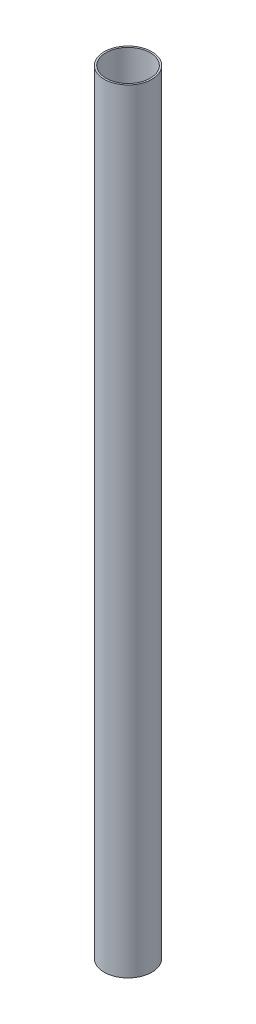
ISO-10303-21;
HEADER;
FILE_DESCRIPTION(('STEP AP214'),'2;1');
FILE_NAME('part.step','',(''),(''),'','','');
FILE_SCHEMA(('AUTOMOTIVE_DESIGN { 1 0 10303 214 1 1 1 1 }'));
ENDSEC;
DATA;
#1=APPLICATION_CONTEXT('core data for automotive mechanical design processes');
#2=APPLICATION_PROTOCOL_DEFINITION('international standard','automotive_design',2000,#1);
#3=PRODUCT_CONTEXT('',#1,'mechanical');
#4=PRODUCT('Part','Part','',(#3));
#5=PRODUCT_RELATED_PRODUCT_CATEGORY('part','',(#4));
#6=PRODUCT_DEFINITION_FORMATION('','',#4);
#7=PRODUCT_DEFINITION_CONTEXT('part definition',#1,'design');
#8=PRODUCT_DEFINITION('design','',#6,#7);
#9=PRODUCT_DEFINITION_SHAPE('','',#8);
#10=(LENGTH_UNIT() NAMED_UNIT(*) SI_UNIT(.MILLI.,.METRE.));
#11=(NAMED_UNIT(*) PLANE_ANGLE_UNIT() SI_UNIT($,.RADIAN.));
#12=(NAMED_UNIT(*) SI_UNIT($,.STERADIAN.) SOLID_ANGLE_UNIT());
#13=UNCERTAINTY_MEASURE_WITH_UNIT(LENGTH_MEASURE(1.E-05),#10,'distance_accuracy_value','');
#14=(GEOMETRIC_REPRESENTATION_CONTEXT(3) GLOBAL_UNCERTAINTY_ASSIGNED_CONTEXT((#13)) GLOBAL_UNIT_ASSIGNED_CONTEXT((#10,
#11,#12)) REPRESENTATION_CONTEXT('',''));
#15=CARTESIAN_POINT('',(0.,0.,0.));
#16=DIRECTION('',(0.,0.,1.));
#17=DIRECTION('',(1.,0.,0.));
#18=AXIS2_PLACEMENT_3D('',#15,#16,#17);
#19=CARTESIAN_POINT('',(0.,609.6,0.));
#20=DIRECTION('',(0.,1.,0.));
#21=DIRECTION('',(0.,0.,1.));
#22=AXIS2_PLACEMENT_3D('',#19,#20,#21);
#23=PLANE('',#22);
#24=CARTESIAN_POINT('',(0.,609.6,0.));
#25=DIRECTION('',(0.,1.,0.));
#26=DIRECTION('',(0.,0.,1.));
#27=AXIS2_PLACEMENT_3D('',#24,#25,#26);
#28=CIRCLE('',#27,18.8087);
#29=CARTESIAN_POINT('',(0.,609.6,-18.8087));
#30=VERTEX_POINT('',#29);
#31=EDGE_CURVE('E10',#30,#30,#28,.T.);
#32=ORIENTED_EDGE('',*,*,#31,.T.);
#33=EDGE_LOOP('',(#32));
#34=FACE_BOUND('',#33,.T.);
#35=CARTESIAN_POINT('',(0.,609.6,0.));
#36=DIRECTION('',(0.,1.,0.));
#37=DIRECTION('',(0.,0.,1.));
#38=AXIS2_PLACEMENT_3D('',#35,#36,#37);
#39=CIRCLE('',#38,17.4625);
#40=CARTESIAN_POINT('',(0.,609.6,-17.4625));
#41=VERTEX_POINT('',#40);
#42=EDGE_CURVE('E42',#41,#41,#39,.T.);
#43=ORIENTED_EDGE('',*,*,#42,.F.);
#44=EDGE_LOOP('',(#43));
#45=FACE_BOUND('',#44,.T.);
#46=ADVANCED_FACE('F31',(#34,#45),#23,.T.);
#47=CARTESIAN_POINT('',(0.,0.,0.));
#48=DIRECTION('',(0.,1.,0.));
#49=DIRECTION('',(0.,0.,1.));
#50=AXIS2_PLACEMENT_3D('',#47,#48,#49);
#51=PLANE('',#50);
#52=CARTESIAN_POINT('',(0.,0.,0.));
#53=DIRECTION('',(0.,1.,0.));
#54=DIRECTION('',(0.,0.,1.));
#55=AXIS2_PLACEMENT_3D('',#52,#53,#54);
#56=CIRCLE('',#55,18.8087);
#57=CARTESIAN_POINT('',(0.,0.,-18.8087));
#58=VERTEX_POINT('',#57);
#59=EDGE_CURVE('E35',#58,#58,#56,.T.);
#60=ORIENTED_EDGE('',*,*,#59,.F.);
#61=EDGE_LOOP('',(#60));
#62=FACE_BOUND('',#61,.T.);
#63=CARTESIAN_POINT('',(0.,0.,0.));
#64=DIRECTION('',(0.,1.,0.));
#65=DIRECTION('',(0.,0.,1.));
#66=AXIS2_PLACEMENT_3D('',#63,#64,#65);
#67=CIRCLE('',#66,17.4625);
#68=CARTESIAN_POINT('',(0.,0.,-17.4625));
#69=VERTEX_POINT('',#68);
#70=EDGE_CURVE('E44',#69,#69,#67,.T.);
#71=ORIENTED_EDGE('',*,*,#70,.T.);
#72=EDGE_LOOP('',(#71));
#73=FACE_BOUND('',#72,.T.);
#74=ADVANCED_FACE('F54',(#62,#73),#51,.F.);
#75=CARTESIAN_POINT('',(0.,609.6,0.));
#76=DIRECTION('',(0.,-1.,0.));
#77=DIRECTION('',(0.,0.,-1.));
#78=AXIS2_PLACEMENT_3D('',#75,#76,#77);
#79=CYLINDRICAL_SURFACE('',#78,18.8087);
#80=CARTESIAN_POINT('',(0.,609.6,-18.8087));
#81=CARTESIAN_POINT('',(0.,603.25,-18.8087));
#82=CARTESIAN_POINT('',(0.,596.9,-18.8087));
#83=CARTESIAN_POINT('',(0.,584.2,-18.8087));
#84=CARTESIAN_POINT('',(0.,577.85,-18.8087));
#85=CARTESIAN_POINT('',(0.,565.15,-18.8087));
#86=CARTESIAN_POINT('',(0.,558.8,-18.8087));
#87=CARTESIAN_POINT('',(0.,546.1,-18.8087));
#88=CARTESIAN_POINT('',(0.,539.75,-18.8087));
#89=CARTESIAN_POINT('',(0.,527.05,-18.8087));
#90=CARTESIAN_POINT('',(0.,520.7,-18.8087));
#91=CARTESIAN_POINT('',(0.,508.,-18.8087));
#92=CARTESIAN_POINT('',(0.,501.65,-18.8087));
#93=CARTESIAN_POINT('',(0.,488.95,-18.8087));
#94=CARTESIAN_POINT('',(0.,482.6,-18.8087));
#95=CARTESIAN_POINT('',(0.,469.9,-18.8087));
#96=CARTESIAN_POINT('',(0.,463.55,-18.8087));
#97=CARTESIAN_POINT('',(0.,450.85,-18.8087));
#98=CARTESIAN_POINT('',(0.,444.5,-18.8087));
#99=CARTESIAN_POINT('',(0.,431.8,-18.8087));
#100=CARTESIAN_POINT('',(0.,425.45,-18.8087));
#101=CARTESIAN_POINT('',(0.,412.75,-18.8087));
#102=CARTESIAN_POINT('',(0.,406.4,-18.8087));
#103=CARTESIAN_POINT('',(0.,393.7,-18.8087));
#104=CARTESIAN_POINT('',(0.,387.35,-18.8087));
#105=CARTESIAN_POINT('',(0.,374.65,-18.8087));
#106=CARTESIAN_POINT('',(0.,368.3,-18.8087));
#107=CARTESIAN_POINT('',(0.,355.6,-18.8087));
#108=CARTESIAN_POINT('',(0.,349.25,-18.8087));
#109=CARTESIAN_POINT('',(0.,336.55,-18.8087));
#110=CARTESIAN_POINT('',(0.,330.2,-18.8087));
#111=CARTESIAN_POINT('',(0.,317.5,-18.8087));
#112=CARTESIAN_POINT('',(0.,311.15,-18.8087));
#113=CARTESIAN_POINT('',(0.,298.45,-18.8087));
#114=CARTESIAN_POINT('',(0.,292.1,-18.8087));
#115=CARTESIAN_POINT('',(0.,279.4,-18.8087));
#116=CARTESIAN_POINT('',(0.,273.05,-18.8087));
#117=CARTESIAN_POINT('',(0.,260.35,-18.8087));
#118=CARTESIAN_POINT('',(0.,254.,-18.8087));
#119=CARTESIAN_POINT('',(0.,241.3,-18.8087));
#120=CARTESIAN_POINT('',(0.,234.95,-18.8087));
#121=CARTESIAN_POINT('',(0.,222.25,-18.8087));
#122=CARTESIAN_POINT('',(0.,215.9,-18.8087));
#123=CARTESIAN_POINT('',(0.,203.2,-18.8087));
#124=CARTESIAN_POINT('',(0.,196.85,-18.8087));
#125=CARTESIAN_POINT('',(0.,184.15,-18.8087));
#126=CARTESIAN_POINT('',(0.,177.8,-18.8087));
#127=CARTESIAN_POINT('',(0.,165.1,-18.8087));
#128=CARTESIAN_POINT('',(0.,158.75,-18.8087));
#129=CARTESIAN_POINT('',(0.,146.05,-18.8087));
#130=CARTESIAN_POINT('',(0.,139.7,-18.8087));
#131=CARTESIAN_POINT('',(0.,127.,-18.8087));
#132=CARTESIAN_POINT('',(0.,120.65,-18.8087));
#133=CARTESIAN_POINT('',(0.,107.95,-18.8087));
#134=CARTESIAN_POINT('',(0.,101.6,-18.8087));
#135=CARTESIAN_POINT('',(0.,88.9,-18.8087));
#136=CARTESIAN_POINT('',(0.,82.5500000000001,-18.8087));
#137=CARTESIAN_POINT('',(0.,69.85,-18.8087));
#138=CARTESIAN_POINT('',(0.,63.5,-18.8087));
#139=CARTESIAN_POINT('',(0.,50.8,-18.8087));
#140=CARTESIAN_POINT('',(0.,44.45,-18.8087));
#141=CARTESIAN_POINT('',(0.,31.75,-18.8087));
#142=CARTESIAN_POINT('',(0.,25.4,-18.8087));
#143=CARTESIAN_POINT('',(0.,12.7,-18.8087));
#144=CARTESIAN_POINT('',(0.,6.35000000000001,-18.8087));
#145=CARTESIAN_POINT('',(0.,0.,-18.8087));
#146=B_SPLINE_CURVE_WITH_KNOTS('',3,(#80,#81,#82,#83,#84,#85,#86,#87,#88,#89,#90,#91,#92,#93,
#94,#95,#96,#97,#98,#99,#100,#101,#102,#103,#104,#105,#106,#107,#108,#109,#110,#111,#112,#113,
#114,#115,#116,#117,#118,#119,#120,#121,#122,#123,#124,#125,#126,#127,#128,#129,#130,#131,#132,
#133,#134,#135,#136,#137,#138,#139,#140,#141,#142,#143,#144,#145),.UNSPECIFIED.,.F.,.F.,(4,2,2,
2,2,2,2,2,2,2,2,2,2,2,2,2,2,2,2,2,2,2,2,2,2,2,2,2,2,2,2,2,4),(0.,19.0499999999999,
38.0999999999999,57.1499999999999,76.1999999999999,95.2499999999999,114.3,133.35,152.4,171.45,
190.5,209.55,228.6,247.65,266.7,285.75,304.8,323.85,342.9,361.95,381.,400.05,419.1,438.15,457.2,
476.25,495.3,514.35,533.4,552.45,571.5,590.55,609.6),.UNSPECIFIED.);
#147=EDGE_CURVE('BSEAM33',#30,#58,#146,.T.);
#148=ORIENTED_EDGE('',*,*,#31,.F.);
#149=ORIENTED_EDGE('',*,*,#59,.T.);
#150=ORIENTED_EDGE('',*,*,#147,.T.);
#151=ORIENTED_EDGE('',*,*,#147,.F.);
#152=EDGE_LOOP('',(#148,#150,#149,#151));
#153=FACE_BOUND('',#152,.T.);
#154=ADVANCED_FACE('F33',(#153),#79,.T.);
#155=CARTESIAN_POINT('',(0.,609.6,0.));
#156=DIRECTION('',(0.,-1.,0.));
#157=DIRECTION('',(0.,0.,-1.));
#158=AXIS2_PLACEMENT_3D('',#155,#156,#157);
#159=CYLINDRICAL_SURFACE('',#158,17.4625);
#160=CARTESIAN_POINT('',(0.,609.6,-17.4625));
#161=CARTESIAN_POINT('',(0.,603.25,-17.4625));
#162=CARTESIAN_POINT('',(0.,596.9,-17.4625));
#163=CARTESIAN_POINT('',(0.,584.2,-17.4625));
#164=CARTESIAN_POINT('',(0.,577.85,-17.4625));
#165=CARTESIAN_POINT('',(0.,565.15,-17.4625));
#166=CARTESIAN_POINT('',(0.,558.8,-17.4625));
#167=CARTESIAN_POINT('',(0.,546.1,-17.4625));
#168=CARTESIAN_POINT('',(0.,539.75,-17.4625));
#169=CARTESIAN_POINT('',(0.,527.05,-17.4625));
#170=CARTESIAN_POINT('',(0.,520.7,-17.4625));
#171=CARTESIAN_POINT('',(0.,508.,-17.4625));
#172=CARTESIAN_POINT('',(0.,501.65,-17.4625));
#173=CARTESIAN_POINT('',(0.,488.95,-17.4625));
#174=CARTESIAN_POINT('',(0.,482.6,-17.4625));
#175=CARTESIAN_POINT('',(0.,469.9,-17.4625));
#176=CARTESIAN_POINT('',(0.,463.55,-17.4625));
#177=CARTESIAN_POINT('',(0.,450.85,-17.4625));
#178=CARTESIAN_POINT('',(0.,444.5,-17.4625));
#179=CARTESIAN_POINT('',(0.,431.8,-17.4625));
#180=CARTESIAN_POINT('',(0.,425.45,-17.4625));
#181=CARTESIAN_POINT('',(0.,412.75,-17.4625));
#182=CARTESIAN_POINT('',(0.,406.4,-17.4625));
#183=CARTESIAN_POINT('',(0.,393.7,-17.4625));
#184=CARTESIAN_POINT('',(0.,387.35,-17.4625));
#185=CARTESIAN_POINT('',(0.,374.65,-17.4625));
#186=CARTESIAN_POINT('',(0.,368.3,-17.4625));
#187=CARTESIAN_POINT('',(0.,355.6,-17.4625));
#188=CARTESIAN_POINT('',(0.,349.25,-17.4625));
#189=CARTESIAN_POINT('',(0.,336.55,-17.4625));
#190=CARTESIAN_POINT('',(0.,330.2,-17.4625));
#191=CARTESIAN_POINT('',(0.,317.5,-17.4625));
#192=CARTESIAN_POINT('',(0.,311.15,-17.4625));
#193=CARTESIAN_POINT('',(0.,298.45,-17.4625));
#194=CARTESIAN_POINT('',(0.,292.1,-17.4625));
#195=CARTESIAN_POINT('',(0.,279.4,-17.4625));
#196=CARTESIAN_POINT('',(0.,273.05,-17.4625));
#197=CARTESIAN_POINT('',(0.,260.35,-17.4625));
#198=CARTESIAN_POINT('',(0.,254.,-17.4625));
#199=CARTESIAN_POINT('',(0.,241.3,-17.4625));
#200=CARTESIAN_POINT('',(0.,234.95,-17.4625));
#201=CARTESIAN_POINT('',(0.,222.25,-17.4625));
#202=CARTESIAN_POINT('',(0.,215.9,-17.4625));
#203=CARTESIAN_POINT('',(0.,203.2,-17.4625));
#204=CARTESIAN_POINT('',(0.,196.85,-17.4625));
#205=CARTESIAN_POINT('',(0.,184.15,-17.4625));
#206=CARTESIAN_POINT('',(0.,177.8,-17.4625));
#207=CARTESIAN_POINT('',(0.,165.1,-17.4625));
#208=CARTESIAN_POINT('',(0.,158.75,-17.4625));
#209=CARTESIAN_POINT('',(0.,146.05,-17.4625));
#210=CARTESIAN_POINT('',(0.,139.7,-17.4625));
#211=CARTESIAN_POINT('',(0.,127.,-17.4625));
#212=CARTESIAN_POINT('',(0.,120.65,-17.4625));
#213=CARTESIAN_POINT('',(0.,107.95,-17.4625));
#214=CARTESIAN_POINT('',(0.,101.6,-17.4625));
#215=CARTESIAN_POINT('',(0.,88.9,-17.4625));
#216=CARTESIAN_POINT('',(0.,82.5500000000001,-17.4625));
#217=CARTESIAN_POINT('',(0.,69.85,-17.4625));
#218=CARTESIAN_POINT('',(0.,63.5,-17.4625));
#219=CARTESIAN_POINT('',(0.,50.8,-17.4625));
#220=CARTESIAN_POINT('',(0.,44.45,-17.4625));
#221=CARTESIAN_POINT('',(0.,31.75,-17.4625));
#222=CARTESIAN_POINT('',(0.,25.4,-17.4625));
#223=CARTESIAN_POINT('',(0.,12.7,-17.4625));
#224=CARTESIAN_POINT('',(0.,6.35000000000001,-17.4625));
#225=CARTESIAN_POINT('',(0.,0.,-17.4625));
#226=B_SPLINE_CURVE_WITH_KNOTS('',3,(#160,#161,#162,#163,#164,#165,#166,#167,#168,#169,#170,
#171,#172,#173,#174,#175,#176,#177,#178,#179,#180,#181,#182,#183,#184,#185,#186,#187,#188,#189,
#190,#191,#192,#193,#194,#195,#196,#197,#198,#199,#200,#201,#202,#203,#204,#205,#206,#207,#208,
#209,#210,#211,#212,#213,#214,#215,#216,#217,#218,#219,#220,#221,#222,#223,#224,#225),
.UNSPECIFIED.,.F.,.F.,(4,2,2,2,2,2,2,2,2,2,2,2,2,2,2,2,2,2,2,2,2,2,2,2,2,2,2,2,2,2,2,2,4),(0.,
19.05,38.1,57.15,76.2,95.2500000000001,114.3,133.35,152.4,171.45,190.5,209.55,228.6,247.65,
266.7,285.75,304.8,323.85,342.9,361.95,381.,400.05,419.1,438.15,457.2,476.25,495.3,514.35,533.4,
552.45,571.5,590.55,609.6),.UNSPECIFIED.);
#227=EDGE_CURVE('BSEAM50',#41,#69,#226,.T.);
#228=ORIENTED_EDGE('',*,*,#42,.T.);
#229=ORIENTED_EDGE('',*,*,#70,.F.);
#230=ORIENTED_EDGE('',*,*,#227,.T.);
#231=ORIENTED_EDGE('',*,*,#227,.F.);
#232=EDGE_LOOP('',(#228,#230,#229,#231));
#233=FACE_BOUND('',#232,.T.);
#234=ADVANCED_FACE('F50',(#233),#159,.F.);
#235=CLOSED_SHELL('',(#46,#74,#154,#234));
#236=MANIFOLD_SOLID_BREP('B2',#235);
#237=ADVANCED_BREP_SHAPE_REPRESENTATION('',(#18,#236),#14);
#238=SHAPE_DEFINITION_REPRESENTATION(#9,#237);
ENDSEC;
END-ISO-10303-21;
